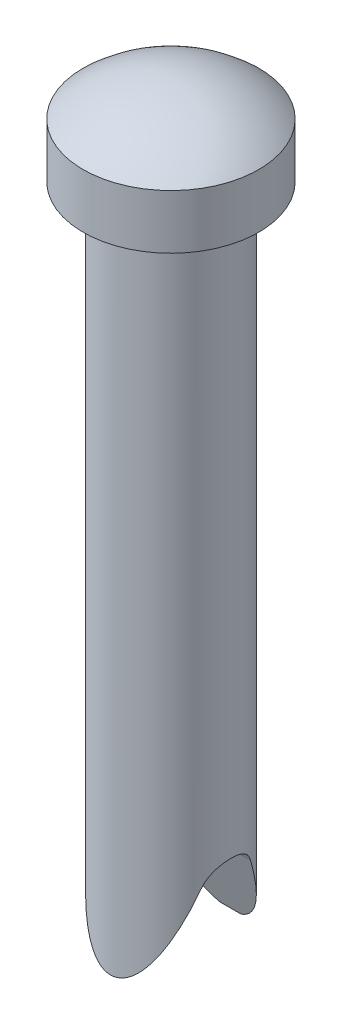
ISO-10303-21;
HEADER;
FILE_DESCRIPTION(('STEP AP214'),'2;1');
FILE_NAME('part.step','',(''),(''),'','','');
FILE_SCHEMA(('AUTOMOTIVE_DESIGN { 1 0 10303 214 1 1 1 1 }'));
ENDSEC;
DATA;
#1=APPLICATION_CONTEXT('core data for automotive mechanical design processes');
#2=APPLICATION_PROTOCOL_DEFINITION('international standard','automotive_design',2000,#1);
#3=PRODUCT_CONTEXT('',#1,'mechanical');
#4=PRODUCT('Part','Part','',(#3));
#5=PRODUCT_RELATED_PRODUCT_CATEGORY('part','',(#4));
#6=PRODUCT_DEFINITION_FORMATION('','',#4);
#7=PRODUCT_DEFINITION_CONTEXT('part definition',#1,'design');
#8=PRODUCT_DEFINITION('design','',#6,#7);
#9=PRODUCT_DEFINITION_SHAPE('','',#8);
#10=(LENGTH_UNIT() NAMED_UNIT(*) SI_UNIT(.MILLI.,.METRE.));
#11=(NAMED_UNIT(*) PLANE_ANGLE_UNIT() SI_UNIT($,.RADIAN.));
#12=(NAMED_UNIT(*) SI_UNIT($,.STERADIAN.) SOLID_ANGLE_UNIT());
#13=UNCERTAINTY_MEASURE_WITH_UNIT(LENGTH_MEASURE(1.E-05),#10,'distance_accuracy_value','');
#14=(GEOMETRIC_REPRESENTATION_CONTEXT(3) GLOBAL_UNCERTAINTY_ASSIGNED_CONTEXT((#13)) GLOBAL_UNIT_ASSIGNED_CONTEXT((#10,
#11,#12)) REPRESENTATION_CONTEXT('',''));
#15=CARTESIAN_POINT('',(0.,0.,0.));
#16=DIRECTION('',(0.,0.,1.));
#17=DIRECTION('',(1.,0.,0.));
#18=AXIS2_PLACEMENT_3D('',#15,#16,#17);
#19=CARTESIAN_POINT('',(0.,0.,0.));
#20=DIRECTION('',(0.,1.,0.));
#21=DIRECTION('',(-1.,0.,0.));
#22=AXIS2_PLACEMENT_3D('',#19,#20,#21);
#23=PLANE('',#22);
#24=CARTESIAN_POINT('',(0.,0.,0.));
#25=DIRECTION('',(0.,-1.,0.));
#26=DIRECTION('',(1.,0.,0.));
#27=AXIS2_PLACEMENT_3D('',#24,#25,#26);
#28=CIRCLE('',#27,2.75);
#29=CARTESIAN_POINT('',(2.75,0.,0.));
#30=VERTEX_POINT('',#29);
#31=EDGE_CURVE('E109',#30,#30,#28,.T.);
#32=ORIENTED_EDGE('',*,*,#31,.F.);
#33=EDGE_LOOP('',(#32));
#34=FACE_BOUND('',#33,.T.);
#35=CARTESIAN_POINT('',(0.,0.,0.));
#36=DIRECTION('',(0.,1.,0.));
#37=DIRECTION('',(-1.,0.,0.));
#38=AXIS2_PLACEMENT_3D('',#35,#36,#37);
#39=CIRCLE('',#38,4.);
#40=CARTESIAN_POINT('',(-4.,0.,0.));
#41=VERTEX_POINT('',#40);
#42=EDGE_CURVE('E113',#41,#41,#39,.T.);
#43=ORIENTED_EDGE('',*,*,#42,.F.);
#44=EDGE_LOOP('',(#43));
#45=FACE_BOUND('',#44,.T.);
#46=ADVANCED_FACE('F41',(#34,#45),#23,.F.);
#47=CARTESIAN_POINT('',(0.,0.,0.));
#48=DIRECTION('',(0.,1.,0.));
#49=DIRECTION('',(-1.,0.,0.));
#50=AXIS2_PLACEMENT_3D('',#47,#48,#49);
#51=CYLINDRICAL_SURFACE('',#50,4.);
#52=CARTESIAN_POINT('',(0.,2.47213595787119,0.));
#53=DIRECTION('',(0.,1.,0.));
#54=DIRECTION('',(-1.,0.,0.));
#55=AXIS2_PLACEMENT_3D('',#52,#53,#54);
#56=CIRCLE('',#55,4.);
#57=CARTESIAN_POINT('',(-4.,2.47213595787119,0.));
#58=VERTEX_POINT('',#57);
#59=EDGE_CURVE('E117',#58,#58,#56,.T.);
#60=ORIENTED_EDGE('',*,*,#59,.F.);
#61=EDGE_LOOP('',(#60));
#62=FACE_BOUND('',#61,.T.);
#63=ORIENTED_EDGE('',*,*,#42,.T.);
#64=EDGE_LOOP('',(#63));
#65=FACE_BOUND('',#64,.T.);
#66=ADVANCED_FACE('F149',(#62,#65),#51,.T.);
#67=CARTESIAN_POINT('',(0.,-1.99999999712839,0.));
#68=DIRECTION('',(0.,1.,0.));
#69=DIRECTION('',(1.,0.,0.));
#70=AXIS2_PLACEMENT_3D('',#67,#68,#69);
#71=SPHERICAL_SURFACE('',#70,6.);
#72=CARTESIAN_POINT('',(0.,4.,0.));
#73=DIRECTION('',(0.,1.,0.));
#74=DIRECTION('',(-1.,0.,0.));
#75=AXIS2_PLACEMENT_3D('',#72,#73,#74);
#76=CIRCLE('',#75,0.000185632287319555);
#77=CARTESIAN_POINT('',(-0.000185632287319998,4.,0.));
#78=VERTEX_POINT('',#77);
#79=EDGE_CURVE('E108',#78,#78,#76,.T.);
#80=ORIENTED_EDGE('',*,*,#79,.F.);
#81=EDGE_LOOP('',(#80));
#82=FACE_BOUND('',#81,.T.);
#83=ORIENTED_EDGE('',*,*,#59,.T.);
#84=EDGE_LOOP('',(#83));
#85=FACE_BOUND('',#84,.T.);
#86=ADVANCED_FACE('F154',(#82,#85),#71,.T.);
#87=CARTESIAN_POINT('',(0.,4.,0.));
#88=DIRECTION('',(0.,-1.,0.));
#89=DIRECTION('',(1.,0.,0.));
#90=AXIS2_PLACEMENT_3D('',#87,#88,#89);
#91=PLANE('',#90);
#92=ORIENTED_EDGE('',*,*,#79,.T.);
#93=EDGE_LOOP('',(#92));
#94=FACE_BOUND('',#93,.T.);
#95=ADVANCED_FACE('F147',(#94),#91,.F.);
#96=CARTESIAN_POINT('',(0.,-30.,0.));
#97=DIRECTION('',(0.,1.,0.));
#98=DIRECTION('',(-1.,0.,0.));
#99=AXIS2_PLACEMENT_3D('',#96,#97,#98);
#100=CYLINDRICAL_SURFACE('',#99,2.75);
#101=CARTESIAN_POINT('',(2.5147678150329,-26.0333381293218,1.11285346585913));
#102=CARTESIAN_POINT('',(2.52663419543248,-25.9697353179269,1.08602396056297));
#103=CARTESIAN_POINT('',(2.54037181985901,-25.9088488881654,1.05384692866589));
#104=CARTESIAN_POINT('',(2.56980705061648,-25.7937585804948,0.979886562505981));
#105=CARTESIAN_POINT('',(2.58550409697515,-25.7395528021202,0.938105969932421));
#106=CARTESIAN_POINT('',(2.61707173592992,-25.6390764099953,0.846047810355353));
#107=CARTESIAN_POINT('',(2.63294217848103,-25.5927994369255,0.795777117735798));
#108=CARTESIAN_POINT('',(2.66318120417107,-25.5092473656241,0.687825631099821));
#109=CARTESIAN_POINT('',(2.67754987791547,-25.4719717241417,0.630145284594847));
#110=CARTESIAN_POINT('',(2.70330145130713,-25.4074583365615,0.508467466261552));
#111=CARTESIAN_POINT('',(2.71467202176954,-25.3802618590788,0.444445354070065));
#112=CARTESIAN_POINT('',(2.73304692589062,-25.3372480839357,0.312098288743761));
#113=CARTESIAN_POINT('',(2.74005395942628,-25.3214237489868,0.243776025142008));
#114=CARTESIAN_POINT('',(2.74853766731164,-25.3026513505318,0.11032659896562));
#115=CARTESIAN_POINT('',(2.75039127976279,-25.2988228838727,0.0453466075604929));
#116=CARTESIAN_POINT('',(2.74947051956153,-25.3017215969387,-0.0843362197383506));
#117=CARTESIAN_POINT('',(2.7466971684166,-25.3084464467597,-0.149039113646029));
#118=CARTESIAN_POINT('',(2.73705598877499,-25.3316261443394,-0.273404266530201));
#119=CARTESIAN_POINT('',(2.73037160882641,-25.3476447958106,-0.333163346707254));
#120=CARTESIAN_POINT('',(2.71371261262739,-25.3884545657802,-0.449107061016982));
#121=CARTESIAN_POINT('',(2.70373757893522,-25.4132467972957,-0.505291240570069));
#122=CARTESIAN_POINT('',(2.68091004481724,-25.4721058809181,-0.615233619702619));
#123=CARTESIAN_POINT('',(2.66795023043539,-25.5065328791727,-0.66877624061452));
#124=CARTESIAN_POINT('',(2.64064405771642,-25.5831857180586,-0.769565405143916));
#125=CARTESIAN_POINT('',(2.62629688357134,-25.6254161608,-0.816808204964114));
#126=CARTESIAN_POINT('',(2.59487562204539,-25.7252834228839,-0.912188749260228));
#127=CARTESIAN_POINT('',(2.57778943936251,-25.7843249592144,-0.958866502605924));
#128=CARTESIAN_POINT('',(2.54585761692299,-25.9105652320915,-1.04069366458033));
#129=CARTESIAN_POINT('',(2.53101538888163,-25.9777761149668,-1.07582561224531));
#130=CARTESIAN_POINT('',(2.51848837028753,-26.0481884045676,-1.10440768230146));
#131=B_SPLINE_CURVE_WITH_KNOTS('',3,(#101,#102,#103,#104,#105,#106,#107,#108,#109,#110,#111,
#112,#113,#114,#115,#116,#117,#118,#119,#120,#121,#122,#123,#124,#125,#126,#127,#128,#129,#130),
.UNSPECIFIED.,.F.,.F.,(4,2,2,2,2,2,2,2,2,2,2,2,2,2,4),(0.,0.209714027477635,0.419368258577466,
0.628853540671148,0.838326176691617,1.04864725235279,1.25883806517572,1.45319058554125,
1.64750020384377,1.83335327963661,2.01922994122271,2.2132867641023,2.40745840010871,
2.63765315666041,2.86819445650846),.UNSPECIFIED.);
#132=CARTESIAN_POINT('',(2.5147678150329,-26.0333381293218,1.11285346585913));
#133=VERTEX_POINT('',#132);
#134=CARTESIAN_POINT('',(2.51848837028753,-26.0481884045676,-1.10440768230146));
#135=VERTEX_POINT('',#134);
#136=EDGE_CURVE('E11',#133,#135,#131,.T.);
#137=ORIENTED_EDGE('',*,*,#136,.T.);
#138=CARTESIAN_POINT('',(0.,-23.3305733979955,0.));
#139=DIRECTION('',(0.,0.376487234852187,-0.926421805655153));
#140=DIRECTION('',(0.,0.926421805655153,0.376487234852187));
#141=AXIS2_PLACEMENT_3D('',#138,#139,#140);
#142=ELLIPSE('',#141,7.30436451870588,2.75);
#143=CARTESIAN_POINT('',(0.465131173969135,-30.,-2.71037875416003));
#144=VERTEX_POINT('',#143);
#145=EDGE_CURVE('E92',#135,#144,#142,.T.);
#146=ORIENTED_EDGE('',*,*,#145,.T.);
#147=CARTESIAN_POINT('',(0.,-30.,0.));
#148=DIRECTION('',(0.,-1.,0.));
#149=DIRECTION('',(1.,0.,0.));
#150=AXIS2_PLACEMENT_3D('',#147,#148,#149);
#151=CIRCLE('',#150,2.75);
#152=CARTESIAN_POINT('',(-0.465131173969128,-30.,-2.71037875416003));
#153=VERTEX_POINT('',#152);
#154=EDGE_CURVE('E99',#153,#144,#151,.T.);
#155=ORIENTED_EDGE('',*,*,#154,.F.);
#156=CARTESIAN_POINT('',(-2.51848837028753,-26.0481884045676,-1.10440768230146));
#157=VERTEX_POINT('',#156);
#158=EDGE_CURVE('E62',#153,#157,#142,.T.);
#159=ORIENTED_EDGE('',*,*,#158,.T.);
#160=CARTESIAN_POINT('',(-2.51848837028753,-26.0481884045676,-1.10440768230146));
#161=CARTESIAN_POINT('',(-2.52985233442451,-25.9843241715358,-1.07847220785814));
#162=CARTESIAN_POINT('',(-2.5431187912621,-25.9230940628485,-1.04716353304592));
#163=CARTESIAN_POINT('',(-2.57169373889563,-25.807181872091,-0.974888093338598));
#164=CARTESIAN_POINT('',(-2.58700127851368,-25.7524967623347,-0.933925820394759));
#165=CARTESIAN_POINT('',(-2.617895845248,-25.6509367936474,-0.843444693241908));
#166=CARTESIAN_POINT('',(-2.63348261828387,-25.6040551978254,-0.793933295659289));
#167=CARTESIAN_POINT('',(-2.66326855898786,-25.5191615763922,-0.687426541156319));
#168=CARTESIAN_POINT('',(-2.6774677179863,-25.4811496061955,-0.63043113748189));
#169=CARTESIAN_POINT('',(-2.70302626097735,-25.4149399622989,-0.509869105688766));
#170=CARTESIAN_POINT('',(-2.71436596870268,-25.3868097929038,-0.446260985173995));
#171=CARTESIAN_POINT('',(-2.73275366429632,-25.3418620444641,-0.314585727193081));
#172=CARTESIAN_POINT('',(-2.73980430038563,-25.3250374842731,-0.246521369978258));
#173=CARTESIAN_POINT('',(-2.74841754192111,-25.3042836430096,-0.113265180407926));
#174=CARTESIAN_POINT('',(-2.75034542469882,-25.2994974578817,-0.0482299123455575));
#175=CARTESIAN_POINT('',(-2.7495526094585,-25.3005230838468,0.0817204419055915));
#176=CARTESIAN_POINT('',(-2.7468329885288,-25.3063324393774,0.146635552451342));
#177=CARTESIAN_POINT('',(-2.73725515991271,-25.3277702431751,0.27143736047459));
#178=CARTESIAN_POINT('',(-2.73058994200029,-25.3429421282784,0.33141864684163));
#179=CARTESIAN_POINT('',(-2.71391431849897,-25.3821050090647,0.447922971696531));
#180=CARTESIAN_POINT('',(-2.70390354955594,-25.4060969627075,0.504445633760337));
#181=CARTESIAN_POINT('',(-2.68095038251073,-25.4633273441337,0.615087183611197));
#182=CARTESIAN_POINT('',(-2.66790202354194,-25.4969135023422,0.669003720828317));
#183=CARTESIAN_POINT('',(-2.64033246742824,-25.5719267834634,0.770665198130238));
#184=CARTESIAN_POINT('',(-2.62581033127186,-25.6133589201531,0.818406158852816));
#185=CARTESIAN_POINT('',(-2.59377699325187,-25.7119053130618,0.91537263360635));
#186=CARTESIAN_POINT('',(-2.57623163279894,-25.7705026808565,0.963094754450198));
#187=CARTESIAN_POINT('',(-2.54328242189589,-25.8960664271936,1.04702361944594));
#188=CARTESIAN_POINT('',(-2.52788159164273,-25.9630443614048,1.08321421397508));
#189=CARTESIAN_POINT('',(-2.51476781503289,-26.0333381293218,1.11285346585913));
#190=B_SPLINE_CURVE_WITH_KNOTS('',3,(#160,#161,#162,#163,#164,#165,#166,#167,#168,#169,#170,
#171,#172,#173,#174,#175,#176,#177,#178,#179,#180,#181,#182,#183,#184,#185,#186,#187,#188,#189),
.UNSPECIFIED.,.F.,.F.,(4,2,2,2,2,2,2,2,2,2,2,2,2,2,4),(0.,0.209162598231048,0.418228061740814,
0.627112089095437,0.835997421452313,1.04628313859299,1.25643888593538,1.4511483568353,
1.64581270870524,1.83166183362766,2.0175311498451,2.21125071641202,2.40509449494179,
2.63648268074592,2.86819351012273),.UNSPECIFIED.);
#191=CARTESIAN_POINT('',(-2.51476781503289,-26.0333381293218,1.11285346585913));
#192=VERTEX_POINT('',#191);
#193=EDGE_CURVE('E81',#157,#192,#190,.T.);
#194=ORIENTED_EDGE('',*,*,#193,.T.);
#195=CARTESIAN_POINT('',(0.,-23.3967574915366,0.));
#196=DIRECTION('',(0.,0.388862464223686,0.921295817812));
#197=DIRECTION('',(0.,0.921295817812,-0.388862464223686));
#198=AXIS2_PLACEMENT_3D('',#195,#196,#197);
#199=ELLIPSE('',#198,7.07190910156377,2.75);
#200=EDGE_CURVE('E55',#192,#133,#199,.T.);
#201=ORIENTED_EDGE('',*,*,#200,.T.);
#202=EDGE_LOOP('',(#137,#146,#155,#159,#194,#201));
#203=FACE_BOUND('',#202,.T.);
#204=ORIENTED_EDGE('',*,*,#31,.T.);
#205=EDGE_LOOP('',(#204));
#206=FACE_BOUND('',#205,.T.);
#207=ADVANCED_FACE('F96',(#203,#206),#100,.T.);
#208=CARTESIAN_POINT('',(0.,-30.,0.));
#209=DIRECTION('',(0.,-1.,0.));
#210=DIRECTION('',(1.,0.,0.));
#211=AXIS2_PLACEMENT_3D('',#208,#209,#210);
#212=PLANE('',#211);
#213=DIRECTION('',(1.,0.,0.));
#214=VECTOR('',#213,1.);
#215=CARTESIAN_POINT('',(0.,-30.,-2.71037875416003));
#216=LINE('',#215,#214);
#217=EDGE_CURVE('E88',#153,#144,#216,.T.);
#218=ORIENTED_EDGE('',*,*,#217,.F.);
#219=ORIENTED_EDGE('',*,*,#154,.T.);
#220=EDGE_LOOP('',(#218,#219));
#221=FACE_BOUND('',#220,.T.);
#222=ADVANCED_FACE('F139',(#221),#212,.T.);
#223=CARTESIAN_POINT('',(-4.,-30.,2.78711039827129));
#224=DIRECTION('',(0.,0.388862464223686,0.921295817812));
#225=DIRECTION('',(0.,-0.921295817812,0.388862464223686));
#226=AXIS2_PLACEMENT_3D('',#223,#224,#225);
#227=PLANE('',#226);
#228=DIRECTION('',(1.,0.,0.));
#229=VECTOR('',#228,1.);
#230=CARTESIAN_POINT('',(-4.,-26.0333381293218,1.11285346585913));
#231=LINE('',#230,#229);
#232=EDGE_CURVE('E84',#192,#133,#231,.T.);
#233=ORIENTED_EDGE('',*,*,#232,.T.);
#234=ORIENTED_EDGE('',*,*,#200,.F.);
#235=EDGE_LOOP('',(#233,#234));
#236=FACE_BOUND('',#235,.T.);
#237=ADVANCED_FACE('F136',(#236),#227,.F.);
#238=CARTESIAN_POINT('',(-4.,-26.4999730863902,0.00729848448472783));
#239=DIRECTION('',(1.,0.,0.));
#240=DIRECTION('',(0.,0.,-1.));
#241=AXIS2_PLACEMENT_3D('',#238,#239,#240);
#242=CYLINDRICAL_SURFACE('',#241,1.2);
#243=ORIENTED_EDGE('',*,*,#232,.F.);
#244=ORIENTED_EDGE('',*,*,#193,.F.);
#245=DIRECTION('',(1.,0.,0.));
#246=VECTOR('',#245,1.);
#247=CARTESIAN_POINT('',(-4.,-26.0481884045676,-1.10440768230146));
#248=LINE('',#247,#246);
#249=EDGE_CURVE('E83',#157,#135,#248,.T.);
#250=ORIENTED_EDGE('',*,*,#249,.T.);
#251=ORIENTED_EDGE('',*,*,#136,.F.);
#252=EDGE_LOOP('',(#243,#244,#250,#251));
#253=FACE_BOUND('',#252,.T.);
#254=ADVANCED_FACE('F82',(#253),#242,.F.);
#255=CARTESIAN_POINT('',(-4.,-26.0481884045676,-1.10440768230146));
#256=DIRECTION('',(0.,0.376487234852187,-0.926421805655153));
#257=DIRECTION('',(0.,0.926421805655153,0.376487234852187));
#258=AXIS2_PLACEMENT_3D('',#255,#256,#257);
#259=PLANE('',#258);
#260=ORIENTED_EDGE('',*,*,#249,.F.);
#261=ORIENTED_EDGE('',*,*,#158,.F.);
#262=ORIENTED_EDGE('',*,*,#217,.T.);
#263=ORIENTED_EDGE('',*,*,#145,.F.);
#264=EDGE_LOOP('',(#260,#261,#262,#263));
#265=FACE_BOUND('',#264,.T.);
#266=ADVANCED_FACE('F90',(#265),#259,.F.);
#267=CLOSED_SHELL('',(#46,#66,#86,#95,#207,#222,#237,#254,#266));
#268=MANIFOLD_SOLID_BREP('B2',#267);
#269=ADVANCED_BREP_SHAPE_REPRESENTATION('',(#18,#268),#14);
#270=SHAPE_DEFINITION_REPRESENTATION(#9,#269);
ENDSEC;
END-ISO-10303-21;
